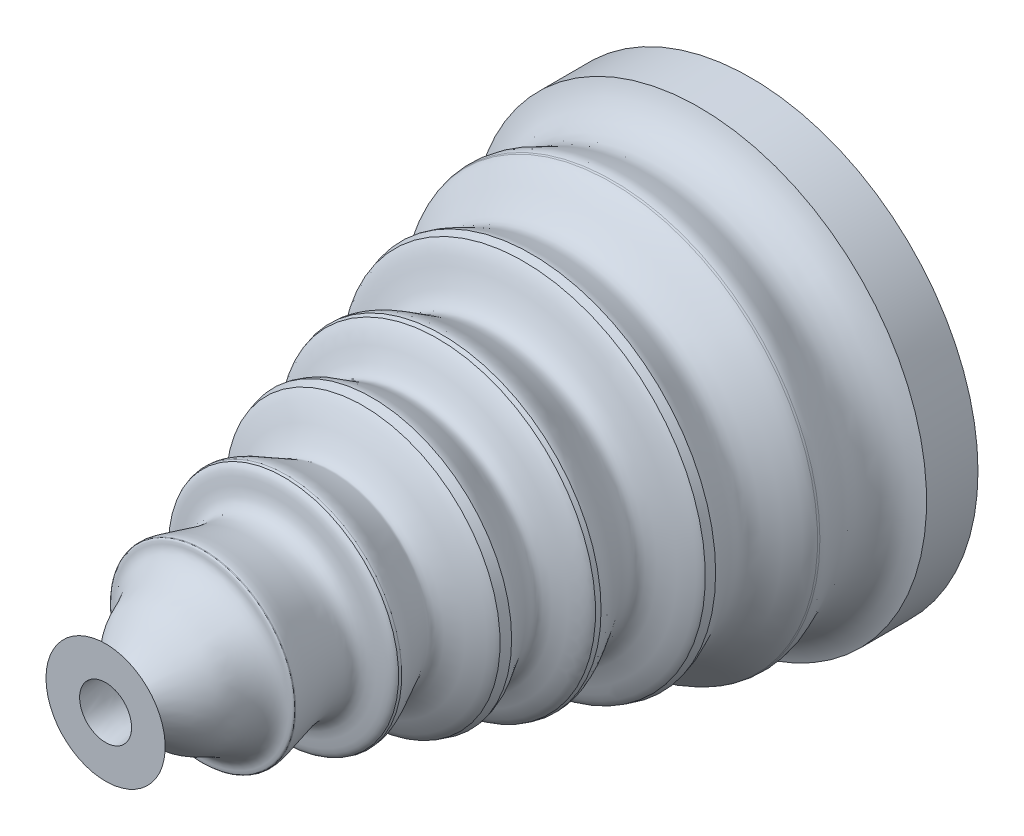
ISO-10303-21;
HEADER;
FILE_DESCRIPTION(('STEP AP214'),'2;1');
FILE_NAME('part.step','',(''),(''),'','','');
FILE_SCHEMA(('AUTOMOTIVE_DESIGN { 1 0 10303 214 1 1 1 1 }'));
ENDSEC;
DATA;
#1=APPLICATION_CONTEXT('core data for automotive mechanical design processes');
#2=APPLICATION_PROTOCOL_DEFINITION('international standard','automotive_design',2000,#1);
#3=PRODUCT_CONTEXT('',#1,'mechanical');
#4=PRODUCT('Part','Part','',(#3));
#5=PRODUCT_RELATED_PRODUCT_CATEGORY('part','',(#4));
#6=PRODUCT_DEFINITION_FORMATION('','',#4);
#7=PRODUCT_DEFINITION_CONTEXT('part definition',#1,'design');
#8=PRODUCT_DEFINITION('design','',#6,#7);
#9=PRODUCT_DEFINITION_SHAPE('','',#8);
#10=(LENGTH_UNIT() NAMED_UNIT(*) SI_UNIT(.MILLI.,.METRE.));
#11=(NAMED_UNIT(*) PLANE_ANGLE_UNIT() SI_UNIT($,.RADIAN.));
#12=(NAMED_UNIT(*) SI_UNIT($,.STERADIAN.) SOLID_ANGLE_UNIT());
#13=UNCERTAINTY_MEASURE_WITH_UNIT(LENGTH_MEASURE(1.E-05),#10,'distance_accuracy_value','');
#14=(GEOMETRIC_REPRESENTATION_CONTEXT(3) GLOBAL_UNCERTAINTY_ASSIGNED_CONTEXT((#13)) GLOBAL_UNIT_ASSIGNED_CONTEXT((#10,
#11,#12)) REPRESENTATION_CONTEXT('',''));
#15=CARTESIAN_POINT('',(0.,0.,0.));
#16=DIRECTION('',(0.,0.,1.));
#17=DIRECTION('',(1.,0.,0.));
#18=AXIS2_PLACEMENT_3D('',#15,#16,#17);
#19=CARTESIAN_POINT('',(0.,0.,5.));
#20=DIRECTION('',(0.,0.,-1.));
#21=DIRECTION('',(-1.,0.,0.));
#22=AXIS2_PLACEMENT_3D('',#19,#20,#21);
#23=CYLINDRICAL_SURFACE('',#22,17.5);
#24=CARTESIAN_POINT('',(0.,0.,0.));
#25=DIRECTION('',(0.,0.,1.));
#26=DIRECTION('',(1.,0.,0.));
#27=AXIS2_PLACEMENT_3D('',#24,#25,#26);
#28=CIRCLE('',#27,17.5);
#29=CARTESIAN_POINT('',(17.5,0.,0.));
#30=VERTEX_POINT('',#29);
#31=EDGE_CURVE('E11',#30,#30,#28,.T.);
#32=ORIENTED_EDGE('',*,*,#31,.T.);
#33=EDGE_LOOP('',(#32));
#34=FACE_BOUND('',#33,.T.);
#35=CARTESIAN_POINT('',(0.,0.,3.95627887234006));
#36=DIRECTION('',(0.,0.,-1.));
#37=DIRECTION('',(-1.,0.,0.));
#38=AXIS2_PLACEMENT_3D('',#35,#36,#37);
#39=CIRCLE('',#38,17.5);
#40=CARTESIAN_POINT('',(-17.5,0.,3.95627887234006));
#41=VERTEX_POINT('',#40);
#42=EDGE_CURVE('E86',#41,#41,#39,.F.);
#43=ORIENTED_EDGE('',*,*,#42,.F.);
#44=EDGE_LOOP('',(#43));
#45=FACE_BOUND('',#44,.T.);
#46=ADVANCED_FACE('F35',(#34,#45),#23,.T.);
#47=CARTESIAN_POINT('',(0.,0.,49.66));
#48=DIRECTION('',(0.,0.,1.));
#49=DIRECTION('',(1.,0.,0.));
#50=AXIS2_PLACEMENT_3D('',#47,#48,#49);
#51=PLANE('',#50);
#52=CARTESIAN_POINT('',(0.,0.,49.66));
#53=DIRECTION('',(0.,0.,1.));
#54=DIRECTION('',(1.,0.,0.));
#55=AXIS2_PLACEMENT_3D('',#52,#53,#54);
#56=CIRCLE('',#55,2.);
#57=CARTESIAN_POINT('',(-1.94648615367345,0.459555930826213,49.66));
#58=VERTEX_POINT('',#57);
#59=EDGE_CURVE('E95',#58,#58,#56,.T.);
#60=ORIENTED_EDGE('',*,*,#59,.F.);
#61=EDGE_LOOP('',(#60));
#62=FACE_BOUND('',#61,.T.);
#63=CARTESIAN_POINT('',(0.,0.,49.66));
#64=DIRECTION('',(0.,0.,-1.));
#65=DIRECTION('',(-1.,0.,0.));
#66=AXIS2_PLACEMENT_3D('',#63,#64,#65);
#67=CIRCLE('',#66,4.58738161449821);
#68=CARTESIAN_POINT('',(-4.58738161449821,0.,49.66));
#69=VERTEX_POINT('',#68);
#70=EDGE_CURVE('E55',#69,#69,#67,.T.);
#71=ORIENTED_EDGE('',*,*,#70,.F.);
#72=EDGE_LOOP('',(#71));
#73=FACE_BOUND('',#72,.T.);
#74=ADVANCED_FACE('F150',(#62,#73),#51,.T.);
#75=CARTESIAN_POINT('',(0.,0.,0.));
#76=DIRECTION('',(0.,0.,1.));
#77=DIRECTION('',(1.,0.,0.));
#78=AXIS2_PLACEMENT_3D('',#75,#76,#77);
#79=PLANE('',#78);
#80=ORIENTED_EDGE('',*,*,#31,.F.);
#81=EDGE_LOOP('',(#80));
#82=FACE_BOUND('',#81,.T.);
#83=CARTESIAN_POINT('',(0.,0.,0.));
#84=DIRECTION('',(0.,0.,1.));
#85=DIRECTION('',(1.,0.,0.));
#86=AXIS2_PLACEMENT_3D('',#83,#84,#85);
#87=CIRCLE('',#86,12.5);
#88=CARTESIAN_POINT('',(12.5,0.,0.));
#89=VERTEX_POINT('',#88);
#90=EDGE_CURVE('E42',#89,#89,#87,.T.);
#91=ORIENTED_EDGE('',*,*,#90,.T.);
#92=EDGE_LOOP('',(#91));
#93=FACE_BOUND('',#92,.T.);
#94=ADVANCED_FACE('F153',(#82,#93),#79,.F.);
#95=CARTESIAN_POINT('',(0.,0.,5.));
#96=DIRECTION('',(0.,0.,-1.));
#97=DIRECTION('',(-1.,0.,0.));
#98=AXIS2_PLACEMENT_3D('',#95,#96,#97);
#99=CYLINDRICAL_SURFACE('',#98,12.5);
#100=CARTESIAN_POINT('',(0.,0.,5.));
#101=DIRECTION('',(0.,0.,-1.));
#102=DIRECTION('',(-1.,0.,0.));
#103=AXIS2_PLACEMENT_3D('',#100,#101,#102);
#104=CIRCLE('',#103,12.5);
#105=CARTESIAN_POINT('',(-12.5,0.,5.));
#106=VERTEX_POINT('',#105);
#107=EDGE_CURVE('E47',#106,#106,#104,.T.);
#108=ORIENTED_EDGE('',*,*,#107,.F.);
#109=EDGE_LOOP('',(#108));
#110=FACE_BOUND('',#109,.T.);
#111=ORIENTED_EDGE('',*,*,#90,.F.);
#112=EDGE_LOOP('',(#111));
#113=FACE_BOUND('',#112,.T.);
#114=ADVANCED_FACE('F131',(#110,#113),#99,.F.);
#115=CARTESIAN_POINT('',(0.,0.,5.));
#116=DIRECTION('',(0.,0.,-1.));
#117=DIRECTION('',(-1.,0.,0.));
#118=AXIS2_PLACEMENT_3D('',#115,#116,#117);
#119=PLANE('',#118);
#120=ORIENTED_EDGE('',*,*,#107,.T.);
#121=EDGE_LOOP('',(#120));
#122=FACE_BOUND('',#121,.T.);
#123=CARTESIAN_POINT('',(0.,0.,5.));
#124=DIRECTION('',(0.,0.,-1.));
#125=DIRECTION('',(-1.,0.,0.));
#126=AXIS2_PLACEMENT_3D('',#123,#124,#125);
#127=CIRCLE('',#126,15.);
#128=CARTESIAN_POINT('',(3.55664166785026,14.5722441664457,5.));
#129=VERTEX_POINT('',#128);
#130=EDGE_CURVE('E90',#129,#129,#127,.T.);
#131=ORIENTED_EDGE('',*,*,#130,.F.);
#132=EDGE_LOOP('',(#131));
#133=FACE_BOUND('',#132,.T.);
#134=ADVANCED_FACE('F121',(#122,#133),#119,.F.);
#135=CARTESIAN_POINT('',(-1.94648615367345,0.459555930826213,49.66));
#136=CARTESIAN_POINT('',(3.55664166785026,14.5722441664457,5.));
#137=CARTESIAN_POINT('',(-1.02737429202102,4.35252823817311,49.66));
#138=CARTESIAN_POINT('',(32.7011300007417,7.45896083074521,5.));
#139=CARTESIAN_POINT('',(2.86559801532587,3.43341637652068,49.66));
#140=CARTESIAN_POINT('',(25.5878466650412,-21.6855275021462,5.));
#141=CARTESIAN_POINT('',(1.94648615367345,-0.459555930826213,49.66));
#142=CARTESIAN_POINT('',(-3.55664166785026,-14.5722441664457,5.));
#143=CARTESIAN_POINT('',(1.02737429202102,-4.35252823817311,49.66));
#144=CARTESIAN_POINT('',(-32.7011300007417,-7.4589608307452,5.));
#145=CARTESIAN_POINT('',(-2.86559801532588,-3.43341637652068,49.66));
#146=CARTESIAN_POINT('',(-25.5878466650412,21.6855275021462,5.));
#147=CARTESIAN_POINT('',(-1.94648615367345,0.459555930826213,49.66));
#148=CARTESIAN_POINT('',(3.55664166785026,14.5722441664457,5.));
#149=(BOUNDED_SURFACE() B_SPLINE_SURFACE(3,1,((#135,#136),(#137,#138),(#139,#140),(#141,#142),
(#143,#144),(#145,#146),(#147,#148)),.UNSPECIFIED.,.T.,.F.,.F.) B_SPLINE_SURFACE_WITH_KNOTS((4,
3,4),(2,2),(0.,0.5,1.),(0.,1.),
.UNSPECIFIED.) GEOMETRIC_REPRESENTATION_ITEM() RATIONAL_B_SPLINE_SURFACE(((1.,1.),
(0.333333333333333,0.333333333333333),(0.333333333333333,0.333333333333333),(1.,1.),
(0.333333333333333,0.333333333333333),(0.333333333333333,0.333333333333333),(1.,1.))) REPRESENTATION_ITEM('') SURFACE());
#150=CARTESIAN_POINT('',(-1.94648615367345,0.459555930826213,49.66));
#151=CARTESIAN_POINT('',(-1.88916190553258,0.606563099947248,49.1947916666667));
#152=CARTESIAN_POINT('',(-1.8318376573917,0.753570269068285,48.7295833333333));
#153=CARTESIAN_POINT('',(-1.71718916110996,1.04758460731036,47.7991666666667));
#154=CARTESIAN_POINT('',(-1.65986491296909,1.1945917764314,47.3339583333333));
#155=CARTESIAN_POINT('',(-1.54521641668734,1.48860611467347,46.4035416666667));
#156=CARTESIAN_POINT('',(-1.48789216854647,1.6356132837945,45.9383333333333));
#157=CARTESIAN_POINT('',(-1.37324367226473,1.92962762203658,45.0079166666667));
#158=CARTESIAN_POINT('',(-1.31591942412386,2.07663479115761,44.5427083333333));
#159=CARTESIAN_POINT('',(-1.20127092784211,2.37064912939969,43.6122916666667));
#160=CARTESIAN_POINT('',(-1.14394667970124,2.51765629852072,43.1470833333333));
#161=CARTESIAN_POINT('',(-1.0292981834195,2.8116706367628,42.2166666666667));
#162=CARTESIAN_POINT('',(-0.971973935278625,2.95867780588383,41.7514583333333));
#163=CARTESIAN_POINT('',(-0.857325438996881,3.25269214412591,40.8210416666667));
#164=CARTESIAN_POINT('',(-0.80000119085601,3.39969931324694,40.3558333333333));
#165=CARTESIAN_POINT('',(-0.685352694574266,3.69371365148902,39.4254166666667));
#166=CARTESIAN_POINT('',(-0.628028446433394,3.84072082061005,38.9602083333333));
#167=CARTESIAN_POINT('',(-0.51337995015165,4.13473515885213,38.0297916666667));
#168=CARTESIAN_POINT('',(-0.456055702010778,4.28174232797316,37.5645833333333));
#169=CARTESIAN_POINT('',(-0.341407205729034,4.57575666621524,36.6341666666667));
#170=CARTESIAN_POINT('',(-0.284082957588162,4.72276383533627,36.1689583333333));
#171=CARTESIAN_POINT('',(-0.169434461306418,5.01677817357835,35.2385416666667));
#172=CARTESIAN_POINT('',(-0.112110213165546,5.16378534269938,34.7733333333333));
#173=CARTESIAN_POINT('',(0.00253828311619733,5.45779968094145,33.8429166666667));
#174=CARTESIAN_POINT('',(0.0598625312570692,5.60480685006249,33.3777083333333));
#175=CARTESIAN_POINT('',(0.174511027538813,5.89882118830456,32.4472916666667));
#176=CARTESIAN_POINT('',(0.231835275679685,6.0458283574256,31.9820833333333));
#177=CARTESIAN_POINT('',(0.346483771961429,6.33984269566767,31.0516666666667));
#178=CARTESIAN_POINT('',(0.403808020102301,6.48684986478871,30.5864583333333));
#179=CARTESIAN_POINT('',(0.518456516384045,6.78086420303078,29.6560416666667));
#180=CARTESIAN_POINT('',(0.575780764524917,6.92787137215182,29.1908333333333));
#181=CARTESIAN_POINT('',(0.690429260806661,7.22188571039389,28.2604166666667));
#182=CARTESIAN_POINT('',(0.747753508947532,7.36889287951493,27.7952083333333));
#183=CARTESIAN_POINT('',(0.862402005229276,7.662907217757,26.8647916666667));
#184=CARTESIAN_POINT('',(0.919726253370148,7.80991438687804,26.3995833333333));
#185=CARTESIAN_POINT('',(1.03437474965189,8.10392872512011,25.4691666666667));
#186=CARTESIAN_POINT('',(1.09169899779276,8.25093589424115,25.0039583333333));
#187=CARTESIAN_POINT('',(1.20634749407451,8.54495023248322,24.0735416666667));
#188=CARTESIAN_POINT('',(1.26367174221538,8.69195740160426,23.6083333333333));
#189=CARTESIAN_POINT('',(1.37832023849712,8.98597173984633,22.6779166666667));
#190=CARTESIAN_POINT('',(1.435644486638,9.13297890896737,22.2127083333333));
#191=CARTESIAN_POINT('',(1.55029298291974,9.42699324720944,21.2822916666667));
#192=CARTESIAN_POINT('',(1.60761723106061,9.57400041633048,20.8170833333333));
#193=CARTESIAN_POINT('',(1.72226572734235,9.86801475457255,19.8866666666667));
#194=CARTESIAN_POINT('',(1.77958997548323,10.0150219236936,19.4214583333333));
#195=CARTESIAN_POINT('',(1.89423847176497,10.3090362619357,18.4910416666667));
#196=CARTESIAN_POINT('',(1.95156271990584,10.4560434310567,18.0258333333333));
#197=CARTESIAN_POINT('',(2.06621121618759,10.7500577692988,17.0954166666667));
#198=CARTESIAN_POINT('',(2.12353546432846,10.8970649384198,16.6302083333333));
#199=CARTESIAN_POINT('',(2.2381839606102,11.1910792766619,15.6997916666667));
#200=CARTESIAN_POINT('',(2.29550820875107,11.3380864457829,15.2345833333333));
#201=CARTESIAN_POINT('',(2.41015670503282,11.632100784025,14.3041666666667));
#202=CARTESIAN_POINT('',(2.46748095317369,11.779107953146,13.8389583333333));
#203=CARTESIAN_POINT('',(2.58212944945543,12.0731222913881,12.9085416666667));
#204=CARTESIAN_POINT('',(2.63945369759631,12.2201294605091,12.4433333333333));
#205=CARTESIAN_POINT('',(2.75410219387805,12.5141437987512,11.5129166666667));
#206=CARTESIAN_POINT('',(2.81142644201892,12.6611509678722,11.0477083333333));
#207=CARTESIAN_POINT('',(2.92607493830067,12.9551653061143,10.1172916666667));
#208=CARTESIAN_POINT('',(2.98339918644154,13.1021724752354,9.65208333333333));
#209=CARTESIAN_POINT('',(3.09804768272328,13.3961868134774,8.72166666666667));
#210=CARTESIAN_POINT('',(3.15537193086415,13.5431939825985,8.25645833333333));
#211=CARTESIAN_POINT('',(3.2700204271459,13.8372083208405,7.32604166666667));
#212=CARTESIAN_POINT('',(3.32734467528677,13.9842154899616,6.86083333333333));
#213=CARTESIAN_POINT('',(3.44199317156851,14.2782298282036,5.93041666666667));
#214=CARTESIAN_POINT('',(3.49931741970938,14.4252369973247,5.46520833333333));
#215=CARTESIAN_POINT('',(3.55664166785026,14.5722441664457,5.));
#216=B_SPLINE_CURVE_WITH_KNOTS('',3,(#150,#151,#152,#153,#154,#155,#156,#157,#158,#159,#160,
#161,#162,#163,#164,#165,#166,#167,#168,#169,#170,#171,#172,#173,#174,#175,#176,#177,#178,#179,
#180,#181,#182,#183,#184,#185,#186,#187,#188,#189,#190,#191,#192,#193,#194,#195,#196,#197,#198,
#199,#200,#201,#202,#203,#204,#205,#206,#207,#208,#209,#210,#211,#212,#213,#214,#215),
.UNSPECIFIED.,.F.,.F.,(4,2,2,2,2,2,2,2,2,2,2,2,2,2,2,2,2,2,2,2,2,2,2,2,2,2,2,2,2,2,2,2,4),(0.,
1.4737176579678,2.94743531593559,4.42115297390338,5.89487063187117,7.36858828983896,
8.84230594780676,10.3160236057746,11.7897412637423,13.2634589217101,14.7371765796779,
16.2108942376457,17.6846118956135,19.1583295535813,20.6320472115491,22.1057648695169,
23.5794825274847,25.0532001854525,26.5269178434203,28.0006355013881,29.4743531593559,
30.9480708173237,32.4217884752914,33.8955061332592,35.369223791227,36.8429414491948,
38.3166591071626,39.7903767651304,41.2640944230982,42.737812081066,44.2115297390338,
45.6852473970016,47.1589650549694),.UNSPECIFIED.);
#217=EDGE_CURVE('BSEAM108',#58,#129,#216,.T.);
#218=ORIENTED_EDGE('',*,*,#59,.T.);
#219=ORIENTED_EDGE('',*,*,#130,.T.);
#220=ORIENTED_EDGE('',*,*,#217,.T.);
#221=ORIENTED_EDGE('',*,*,#217,.F.);
#222=EDGE_LOOP('',(#218,#220,#219,#221));
#223=FACE_BOUND('',#222,.T.);
#224=ADVANCED_FACE('F108',(#223),#149,.F.);
#225=CARTESIAN_POINT('',(17.8257768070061,0.,3.83606462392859));
#226=CARTESIAN_POINT('',(17.0142154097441,0.,4.13178523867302));
#227=CARTESIAN_POINT('',(15.6412611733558,0.,4.63206885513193));
#228=CARTESIAN_POINT('',(14.4632884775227,0.,7.7764561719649));
#229=CARTESIAN_POINT('',(17.3282979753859,0.,10.9502647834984));
#230=CARTESIAN_POINT('',(11.4723480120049,0.,13.8548954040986));
#231=CARTESIAN_POINT('',(16.1964958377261,0.,17.9817050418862));
#232=CARTESIAN_POINT('',(7.83703273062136,0.,18.6869725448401));
#233=CARTESIAN_POINT('',(14.6712603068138,0.,24.5964857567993));
#234=CARTESIAN_POINT('',(7.08197005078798,0.,25.4076483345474));
#235=CARTESIAN_POINT('',(13.1612257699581,0.,30.021324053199));
#236=CARTESIAN_POINT('',(7.49813349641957,0.,31.1449646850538));
#237=CARTESIAN_POINT('',(7.23039829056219,0.,32.4931612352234));
#238=CARTESIAN_POINT('',(10.8837543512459,0.,37.4573986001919));
#239=CARTESIAN_POINT('',(4.4770055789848,0.,35.2190572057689));
#240=CARTESIAN_POINT('',(8.23322338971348,0.,43.801475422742));
#241=CARTESIAN_POINT('',(6.05003540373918,0.,41.661343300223));
#242=CARTESIAN_POINT('',(3.97322000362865,0.,47.0844956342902));
#243=CARTESIAN_POINT('',(-0.644104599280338,0.,49.2619979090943));
#244=CARTESIAN_POINT('',(4.58738161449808,0.,49.66));
#245=B_SPLINE_CURVE_WITH_KNOTS('',3,(#225,#226,#227,#228,#229,#230,#231,#232,#233,#234,#235,
#236,#237,#238,#239,#240,#241,#242,#243,#244),.UNSPECIFIED.,.F.,.F.,(4,1,1,1,1,1,1,1,1,1,2,1,1,
1,2,4),(0.,0.0973177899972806,0.164636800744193,0.249586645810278,0.343652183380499,
0.439128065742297,0.52552908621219,0.624715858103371,0.69585736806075,0.779593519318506,
0.841181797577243,0.86747576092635,0.896379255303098,0.922328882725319,0.94047067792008,
0.9545956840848),.UNSPECIFIED.);
#246=CARTESIAN_POINT('',(0.,0.,5.));
#247=DIRECTION('',(0.,0.,-1.));
#248=AXIS1_PLACEMENT('',#246,#247);
#249=SURFACE_OF_REVOLUTION('',#245,#248);
#250=CARTESIAN_POINT('',(0.,0.,42.1825201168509));
#251=DIRECTION('',(0.,0.,-1.));
#252=DIRECTION('',(-1.,0.,0.));
#253=AXIS2_PLACEMENT_3D('',#250,#251,#252);
#254=CIRCLE('',#253,7.09289069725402);
#255=CARTESIAN_POINT('',(-7.09289069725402,0.,42.1825201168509));
#256=VERTEX_POINT('',#255);
#257=EDGE_CURVE('E51',#256,#256,#254,.T.);
#258=ORIENTED_EDGE('',*,*,#257,.F.);
#259=EDGE_LOOP('',(#258));
#260=FACE_BOUND('',#259,.T.);
#261=ORIENTED_EDGE('',*,*,#70,.T.);
#262=EDGE_LOOP('',(#261));
#263=FACE_BOUND('',#262,.T.);
#264=ADVANCED_FACE('F120',(#260,#263),#249,.F.);
#265=CARTESIAN_POINT('',(0.,0.,10.6019883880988));
#266=DIRECTION('',(0.,0.,-1.));
#267=DIRECTION('',(-1.,0.,0.));
#268=AXIS2_PLACEMENT_3D('',#265,#266,#267);
#269=CIRCLE('',#268,15.9320453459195);
#270=CARTESIAN_POINT('',(-15.9320453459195,0.,10.6019883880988));
#271=VERTEX_POINT('',#270);
#272=EDGE_CURVE('E38',#271,#271,#269,.F.);
#273=ORIENTED_EDGE('',*,*,#272,.F.);
#274=EDGE_LOOP('',(#273));
#275=FACE_BOUND('',#274,.T.);
#276=ORIENTED_EDGE('',*,*,#42,.T.);
#277=EDGE_LOOP('',(#276));
#278=FACE_BOUND('',#277,.T.);
#279=ADVANCED_FACE('F158',(#275,#278),#249,.F.);
#280=CARTESIAN_POINT('',(0.,0.,49.66));
#281=DIRECTION('',(0.,0.,-1.));
#282=DIRECTION('',(-1.,0.,0.));
#283=AXIS2_PLACEMENT_3D('',#280,#281,#282);
#284=CONICAL_SURFACE('',#283,5.,0.272909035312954);
#285=ORIENTED_EDGE('',*,*,#257,.T.);
#286=EDGE_LOOP('',(#285));
#287=FACE_BOUND('',#286,.T.);
#288=CARTESIAN_POINT('',(0.,0.,42.1325882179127));
#289=DIRECTION('',(0.,0.,-1.));
#290=DIRECTION('',(-1.,0.,0.));
#291=AXIS2_PLACEMENT_3D('',#288,#289,#290);
#292=CIRCLE('',#291,7.10686626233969);
#293=CARTESIAN_POINT('',(-7.10686626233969,0.,42.1325882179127));
#294=VERTEX_POINT('',#293);
#295=EDGE_CURVE('E54',#294,#294,#292,.F.);
#296=ORIENTED_EDGE('',*,*,#295,.T.);
#297=EDGE_LOOP('',(#296));
#298=FACE_BOUND('',#297,.T.);
#299=ADVANCED_FACE('F164',(#287,#298),#284,.T.);
#300=CARTESIAN_POINT('',(0.,0.,35.9406637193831));
#301=DIRECTION('',(0.,0.,-1.));
#302=DIRECTION('',(-1.,0.,0.));
#303=AXIS2_PLACEMENT_3D('',#300,#301,#302);
#304=CIRCLE('',#303,8.83993962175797);
#305=CARTESIAN_POINT('',(-8.83993962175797,0.,35.9406637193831));
#306=VERTEX_POINT('',#305);
#307=EDGE_CURVE('E58',#306,#306,#304,.T.);
#308=ORIENTED_EDGE('',*,*,#307,.F.);
#309=EDGE_LOOP('',(#308));
#310=FACE_BOUND('',#309,.T.);
#311=ORIENTED_EDGE('',*,*,#295,.F.);
#312=EDGE_LOOP('',(#311));
#313=FACE_BOUND('',#312,.T.);
#314=ADVANCED_FACE('F160',(#310,#313),#249,.F.);
#315=ORIENTED_EDGE('',*,*,#307,.T.);
#316=EDGE_LOOP('',(#315));
#317=FACE_BOUND('',#316,.T.);
#318=CARTESIAN_POINT('',(0.,0.,35.7507213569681));
#319=DIRECTION('',(0.,0.,-1.));
#320=DIRECTION('',(-1.,0.,0.));
#321=AXIS2_PLACEMENT_3D('',#318,#319,#320);
#322=CIRCLE('',#321,8.89310306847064);
#323=CARTESIAN_POINT('',(-8.89310306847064,0.,35.7507213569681));
#324=VERTEX_POINT('',#323);
#325=EDGE_CURVE('E61',#324,#324,#322,.F.);
#326=ORIENTED_EDGE('',*,*,#325,.T.);
#327=EDGE_LOOP('',(#326));
#328=FACE_BOUND('',#327,.T.);
#329=ADVANCED_FACE('F169',(#317,#328),#284,.T.);
#330=CARTESIAN_POINT('',(0.,0.,29.8380742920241));
#331=DIRECTION('',(0.,0.,-1.));
#332=DIRECTION('',(-1.,0.,0.));
#333=AXIS2_PLACEMENT_3D('',#330,#331,#332);
#334=CIRCLE('',#333,10.5480087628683);
#335=CARTESIAN_POINT('',(-10.5480087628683,0.,29.8380742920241));
#336=VERTEX_POINT('',#335);
#337=EDGE_CURVE('E64',#336,#336,#334,.T.);
#338=ORIENTED_EDGE('',*,*,#337,.F.);
#339=EDGE_LOOP('',(#338));
#340=FACE_BOUND('',#339,.T.);
#341=ORIENTED_EDGE('',*,*,#325,.F.);
#342=EDGE_LOOP('',(#341));
#343=FACE_BOUND('',#342,.T.);
#344=ADVANCED_FACE('F171',(#340,#343),#249,.F.);
#345=ORIENTED_EDGE('',*,*,#337,.T.);
#346=EDGE_LOOP('',(#345));
#347=FACE_BOUND('',#346,.T.);
#348=CARTESIAN_POINT('',(0.,0.,29.1434570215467));
#349=DIRECTION('',(0.,0.,-1.));
#350=DIRECTION('',(-1.,0.,0.));
#351=AXIS2_PLACEMENT_3D('',#348,#349,#350);
#352=CIRCLE('',#351,10.7424269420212);
#353=CARTESIAN_POINT('',(-10.7424269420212,0.,29.1434570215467));
#354=VERTEX_POINT('',#353);
#355=EDGE_CURVE('E67',#354,#354,#352,.F.);
#356=ORIENTED_EDGE('',*,*,#355,.T.);
#357=EDGE_LOOP('',(#356));
#358=FACE_BOUND('',#357,.T.);
#359=ADVANCED_FACE('F223',(#347,#358),#284,.T.);
#360=CARTESIAN_POINT('',(0.,0.,24.0969280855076));
#361=DIRECTION('',(0.,0.,-1.));
#362=DIRECTION('',(-1.,0.,0.));
#363=AXIS2_PLACEMENT_3D('',#360,#361,#362);
#364=CIRCLE('',#363,12.1549126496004);
#365=CARTESIAN_POINT('',(-12.1549126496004,0.,24.0969280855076));
#366=VERTEX_POINT('',#365);
#367=EDGE_CURVE('E70',#366,#366,#364,.T.);
#368=ORIENTED_EDGE('',*,*,#367,.F.);
#369=EDGE_LOOP('',(#368));
#370=FACE_BOUND('',#369,.T.);
#371=ORIENTED_EDGE('',*,*,#355,.F.);
#372=EDGE_LOOP('',(#371));
#373=FACE_BOUND('',#372,.T.);
#374=ADVANCED_FACE('F231',(#370,#373),#249,.F.);
#375=ORIENTED_EDGE('',*,*,#367,.T.);
#376=EDGE_LOOP('',(#375));
#377=FACE_BOUND('',#376,.T.);
#378=CARTESIAN_POINT('',(0.,0.,23.7633795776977));
#379=DIRECTION('',(0.,0.,-1.));
#380=DIRECTION('',(-1.,0.,0.));
#381=AXIS2_PLACEMENT_3D('',#378,#379,#380);
#382=CIRCLE('',#381,12.2482703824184);
#383=CARTESIAN_POINT('',(-12.2482703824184,0.,23.7633795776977));
#384=VERTEX_POINT('',#383);
#385=EDGE_CURVE('E73',#384,#384,#382,.F.);
#386=ORIENTED_EDGE('',*,*,#385,.T.);
#387=EDGE_LOOP('',(#386));
#388=FACE_BOUND('',#387,.T.);
#389=ADVANCED_FACE('F233',(#377,#388),#284,.T.);
#390=CARTESIAN_POINT('',(0.,0.,17.4936284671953));
#391=DIRECTION('',(0.,0.,-1.));
#392=DIRECTION('',(-1.,0.,0.));
#393=AXIS2_PLACEMENT_3D('',#390,#391,#392);
#394=CIRCLE('',#393,14.0031268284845);
#395=CARTESIAN_POINT('',(-14.0031268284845,0.,17.4936284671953));
#396=VERTEX_POINT('',#395);
#397=EDGE_CURVE('E76',#396,#396,#394,.T.);
#398=ORIENTED_EDGE('',*,*,#397,.F.);
#399=EDGE_LOOP('',(#398));
#400=FACE_BOUND('',#399,.T.);
#401=ORIENTED_EDGE('',*,*,#385,.F.);
#402=EDGE_LOOP('',(#401));
#403=FACE_BOUND('',#402,.T.);
#404=ADVANCED_FACE('F241',(#400,#403),#249,.F.);
#405=ORIENTED_EDGE('',*,*,#397,.T.);
#406=EDGE_LOOP('',(#405));
#407=FACE_BOUND('',#406,.T.);
#408=CARTESIAN_POINT('',(0.,0.,16.872087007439));
#409=DIRECTION('',(0.,0.,-1.));
#410=DIRECTION('',(-1.,0.,0.));
#411=AXIS2_PLACEMENT_3D('',#408,#409,#410);
#412=CIRCLE('',#411,14.1770916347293);
#413=CARTESIAN_POINT('',(-14.1770916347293,0.,16.872087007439));
#414=VERTEX_POINT('',#413);
#415=EDGE_CURVE('E79',#414,#414,#412,.F.);
#416=ORIENTED_EDGE('',*,*,#415,.T.);
#417=EDGE_LOOP('',(#416));
#418=FACE_BOUND('',#417,.T.);
#419=ADVANCED_FACE('F243',(#407,#418),#284,.T.);
#420=CARTESIAN_POINT('',(0.,0.,10.7400073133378));
#421=DIRECTION('',(0.,0.,-1.));
#422=DIRECTION('',(-1.,0.,0.));
#423=AXIS2_PLACEMENT_3D('',#420,#421,#422);
#424=CIRCLE('',#423,15.8934148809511);
#425=CARTESIAN_POINT('',(-15.8934148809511,0.,10.7400073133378));
#426=VERTEX_POINT('',#425);
#427=EDGE_CURVE('E81',#426,#426,#424,.T.);
#428=ORIENTED_EDGE('',*,*,#427,.F.);
#429=EDGE_LOOP('',(#428));
#430=FACE_BOUND('',#429,.T.);
#431=ORIENTED_EDGE('',*,*,#415,.F.);
#432=EDGE_LOOP('',(#431));
#433=FACE_BOUND('',#432,.T.);
#434=ADVANCED_FACE('F166',(#430,#433),#249,.F.);
#435=ORIENTED_EDGE('',*,*,#427,.T.);
#436=EDGE_LOOP('',(#435));
#437=FACE_BOUND('',#436,.T.);
#438=ORIENTED_EDGE('',*,*,#272,.T.);
#439=EDGE_LOOP('',(#438));
#440=FACE_BOUND('',#439,.T.);
#441=ADVANCED_FACE('F133',(#437,#440),#284,.T.);
#442=CLOSED_SHELL('',(#46,#74,#94,#114,#134,#224,#264,#279,#299,#314,#329,#344,#359,#374,#389,
#404,#419,#434,#441));
#443=MANIFOLD_SOLID_BREP('B2',#442);
#444=ADVANCED_BREP_SHAPE_REPRESENTATION('',(#18,#443),#14);
#445=SHAPE_DEFINITION_REPRESENTATION(#9,#444);
ENDSEC;
END-ISO-10303-21;
